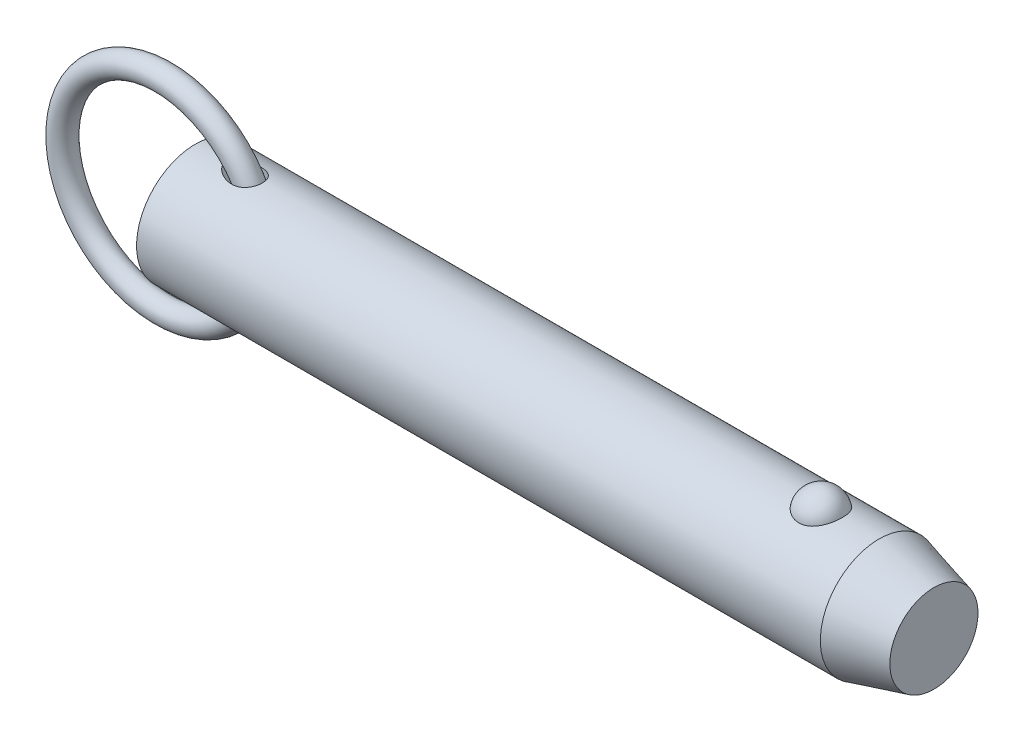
ISO-10303-21;
HEADER;
FILE_DESCRIPTION(('STEP AP214'),'2;1');
FILE_NAME('part.step','',(''),(''),'','','');
FILE_SCHEMA(('AUTOMOTIVE_DESIGN { 1 0 10303 214 1 1 1 1 }'));
ENDSEC;
DATA;
#1=APPLICATION_CONTEXT('core data for automotive mechanical design processes');
#2=APPLICATION_PROTOCOL_DEFINITION('international standard','automotive_design',2000,#1);
#3=PRODUCT_CONTEXT('',#1,'mechanical');
#4=PRODUCT('Part','Part','',(#3));
#5=PRODUCT_RELATED_PRODUCT_CATEGORY('part','',(#4));
#6=PRODUCT_DEFINITION_FORMATION('','',#4);
#7=PRODUCT_DEFINITION_CONTEXT('part definition',#1,'design');
#8=PRODUCT_DEFINITION('design','',#6,#7);
#9=PRODUCT_DEFINITION_SHAPE('','',#8);
#10=(LENGTH_UNIT() NAMED_UNIT(*) SI_UNIT(.MILLI.,.METRE.));
#11=(NAMED_UNIT(*) PLANE_ANGLE_UNIT() SI_UNIT($,.RADIAN.));
#12=(NAMED_UNIT(*) SI_UNIT($,.STERADIAN.) SOLID_ANGLE_UNIT());
#13=UNCERTAINTY_MEASURE_WITH_UNIT(LENGTH_MEASURE(1.E-05),#10,'distance_accuracy_value','');
#14=(GEOMETRIC_REPRESENTATION_CONTEXT(3) GLOBAL_UNCERTAINTY_ASSIGNED_CONTEXT((#13)) GLOBAL_UNIT_ASSIGNED_CONTEXT((#10,
#11,#12)) REPRESENTATION_CONTEXT('',''));
#15=CARTESIAN_POINT('',(0.,0.,0.));
#16=DIRECTION('',(0.,0.,1.));
#17=DIRECTION('',(1.,0.,0.));
#18=AXIS2_PLACEMENT_3D('',#15,#16,#17);
#19=CARTESIAN_POINT('',(-6.08699288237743,0.,0.));
#20=DIRECTION('',(0.,0.,1.));
#21=DIRECTION('',(1.,0.,0.));
#22=AXIS2_PLACEMENT_3D('',#19,#20,#21);
#23=TOROIDAL_SURFACE('',#22,19.05,2.223);
#24=CARTESIAN_POINT('',(15.1860071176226,0.,0.));
#25=VERTEX_POINT('',#24);
#26=VERTEX_LOOP('',#25);
#27=FACE_BOUND('',#26,.T.);
#28=ADVANCED_FACE('P0_F12',(#27),#23,.T.);
#29=CLOSED_SHELL('',(#28));
#30=MANIFOLD_SOLID_BREP('P0_B1',#29);
#31=CARTESIAN_POINT('',(0.,0.,0.));
#32=DIRECTION('',(1.,0.,0.));
#33=DIRECTION('',(0.,0.,-1.));
#34=AXIS2_PLACEMENT_3D('',#31,#32,#33);
#35=CYLINDRICAL_SURFACE('',#34,11.115);
#36=CARTESIAN_POINT('',(6.41405181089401,11.0227946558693,-1.4287136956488));
#37=CARTESIAN_POINT('',(6.49338916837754,11.0115377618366,-1.51556642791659));
#38=CARTESIAN_POINT('',(6.57765461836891,10.9998263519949,-1.59789397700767));
#39=CARTESIAN_POINT('',(6.75386647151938,10.9760304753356,-1.75391400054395));
#40=CARTESIAN_POINT('',(6.84582247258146,10.9639455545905,-1.82759540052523));
#41=CARTESIAN_POINT('',(7.03627827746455,10.9397989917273,-1.96698954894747));
#42=CARTESIAN_POINT('',(7.13480838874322,10.9277377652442,-2.03266078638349));
#43=CARTESIAN_POINT('',(7.33681032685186,10.9041015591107,-2.1558582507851));
#44=CARTESIAN_POINT('',(7.44028007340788,10.8925263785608,-2.21338786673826));
#45=CARTESIAN_POINT('',(7.64386117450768,10.8710104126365,-2.31666528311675));
#46=CARTESIAN_POINT('',(7.74368989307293,10.8610119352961,-2.36295942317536));
#47=CARTESIAN_POINT('',(7.94637195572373,10.8420168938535,-2.44863486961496));
#48=CARTESIAN_POINT('',(8.04922612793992,10.8330206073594,-2.48801426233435));
#49=CARTESIAN_POINT('',(8.36115573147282,10.807980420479,-2.59542730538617));
#50=CARTESIAN_POINT('',(8.57411849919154,10.7938278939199,-2.65299817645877));
#51=CARTESIAN_POINT('',(9.00825016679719,10.7725818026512,-2.73800108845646));
#52=CARTESIAN_POINT('',(9.22947335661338,10.7655491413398,-2.76517330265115));
#53=CARTESIAN_POINT('',(9.67368141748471,10.7605872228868,-2.78445308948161));
#54=CARTESIAN_POINT('',(9.89666486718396,10.7626512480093,-2.77658653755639));
#55=CARTESIAN_POINT('',(10.2950172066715,10.7754452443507,-2.72644436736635));
#56=CARTESIAN_POINT('',(10.4712789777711,10.7844280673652,-2.69109376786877));
#57=CARTESIAN_POINT('',(10.7292776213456,10.8024982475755,-2.61722365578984));
#58=CARTESIAN_POINT('',(10.8142337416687,10.8092901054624,-2.58911576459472));
#59=CARTESIAN_POINT('',(10.9813218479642,10.8242580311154,-2.52581287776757));
#60=CARTESIAN_POINT('',(11.0634550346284,10.8324335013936,-2.49062094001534));
#61=CARTESIAN_POINT('',(11.2247418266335,10.8500287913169,-2.41281958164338));
#62=CARTESIAN_POINT('',(11.3038694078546,10.8594572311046,-2.37015806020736));
#63=CARTESIAN_POINT('',(11.4576781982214,10.8792243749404,-2.27770403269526));
#64=CARTESIAN_POINT('',(11.5323615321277,10.8895626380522,-2.22791497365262));
#65=CARTESIAN_POINT('',(11.6765388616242,10.9108113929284,-2.12140590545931));
#66=CARTESIAN_POINT('',(11.7460329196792,10.9217218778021,-2.06468597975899));
#67=CARTESIAN_POINT('',(11.8790597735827,10.9437207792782,-1.94471764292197));
#68=CARTESIAN_POINT('',(11.9425932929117,10.9548091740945,-1.88147002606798));
#69=CARTESIAN_POINT('',(12.109388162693,10.9851999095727,-1.69784918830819));
#70=CARTESIAN_POINT('',(12.205655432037,11.0042655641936,-1.57093023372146));
#71=CARTESIAN_POINT('',(12.374151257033,11.0393391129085,-1.3017676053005));
#72=CARTESIAN_POINT('',(12.4463875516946,11.0553479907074,-1.15952888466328));
#73=CARTESIAN_POINT('',(12.5615818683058,11.0816338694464,-0.871972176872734));
#74=CARTESIAN_POINT('',(12.6058896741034,11.0921698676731,-0.727217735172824));
#75=CARTESIAN_POINT('',(12.6699315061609,11.1075802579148,-0.432089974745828));
#76=CARTESIAN_POINT('',(12.6896681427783,11.1124552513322,-0.281717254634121));
#77=CARTESIAN_POINT('',(12.7040225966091,11.1159901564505,0.0188164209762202));
#78=CARTESIAN_POINT('',(12.6988836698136,11.1147102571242,0.168965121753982));
#79=CARTESIAN_POINT('',(12.6641681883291,11.1062126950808,0.466238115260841));
#80=CARTESIAN_POINT('',(12.6345920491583,11.0989951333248,0.61336245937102));
#81=CARTESIAN_POINT('',(12.5517453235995,11.0794095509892,0.900330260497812));
#82=CARTESIAN_POINT('',(12.4984878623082,11.0670443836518,1.0401777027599));
#83=CARTESIAN_POINT('',(12.3696588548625,11.0385082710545,1.308745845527));
#84=CARTESIAN_POINT('',(12.2940887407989,11.0223375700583,1.43746725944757));
#85=CARTESIAN_POINT('',(12.122380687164,10.987872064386,1.68079704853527));
#86=CARTESIAN_POINT('',(12.0261637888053,10.969569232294,1.79534850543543));
#87=CARTESIAN_POINT('',(11.8161707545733,10.932836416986,2.00695695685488));
#88=CARTESIAN_POINT('',(11.7023941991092,10.9144064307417,2.10401353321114));
#89=CARTESIAN_POINT('',(11.4575656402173,10.8788057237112,2.28105326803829));
#90=CARTESIAN_POINT('',(11.3261451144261,10.8616794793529,2.36053412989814));
#91=CARTESIAN_POINT('',(11.0523589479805,10.8308019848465,2.49839044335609));
#92=CARTESIAN_POINT('',(10.9099908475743,10.8170514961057,2.55676113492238));
#93=CARTESIAN_POINT('',(10.6060622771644,10.7929728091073,2.65666105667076));
#94=CARTESIAN_POINT('',(10.4438877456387,10.7830209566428,2.69640163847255));
#95=CARTESIAN_POINT('',(10.1154037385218,10.7687230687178,2.75293129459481));
#96=CARTESIAN_POINT('',(9.94909141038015,10.7643810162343,2.76970406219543));
#97=CARTESIAN_POINT('',(9.54387061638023,10.7604809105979,2.7848723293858));
#98=CARTESIAN_POINT('',(9.30446860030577,10.7637793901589,2.77227753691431));
#99=CARTESIAN_POINT('',(8.9496125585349,10.7757341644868,2.72524141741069));
#100=CARTESIAN_POINT('',(8.83186896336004,10.7808994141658,2.70482239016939));
#101=CARTESIAN_POINT('',(8.59835142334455,10.7932548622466,2.6550999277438));
#102=CARTESIAN_POINT('',(8.48257728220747,10.8004448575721,2.62579738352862));
#103=CARTESIAN_POINT('',(8.25208469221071,10.8166382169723,2.55827624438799));
#104=CARTESIAN_POINT('',(8.13740214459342,10.8256649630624,2.51994155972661));
#105=CARTESIAN_POINT('',(7.91132058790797,10.8451170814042,2.43486475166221));
#106=CARTESIAN_POINT('',(7.79992154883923,10.8555424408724,2.38812270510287));
#107=CARTESIAN_POINT('',(7.58115677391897,10.8774251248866,2.28638483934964));
#108=CARTESIAN_POINT('',(7.47378802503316,10.8888816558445,2.23139534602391));
#109=CARTESIAN_POINT('',(7.26385624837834,10.9124540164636,2.1131026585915));
#110=CARTESIAN_POINT('',(7.16129168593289,10.9245696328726,2.04980214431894));
#111=CARTESIAN_POINT('',(6.91882218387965,10.9543689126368,1.88540538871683));
#112=CARTESIAN_POINT('',(6.78193778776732,10.9721958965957,1.77979827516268));
#113=CARTESIAN_POINT('',(6.5247244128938,11.0070222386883,1.54989693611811));
#114=CARTESIAN_POINT('',(6.40436902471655,11.0240228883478,1.42563320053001));
#115=CARTESIAN_POINT('',(6.21838804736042,11.0509658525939,1.19529359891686));
#116=CARTESIAN_POINT('',(6.14691885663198,11.0615430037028,1.09404520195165));
#117=CARTESIAN_POINT('',(6.02043496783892,11.0805004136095,0.881508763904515));
#118=CARTESIAN_POINT('',(5.96539400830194,11.0888841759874,0.770237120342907));
#119=CARTESIAN_POINT('',(5.88475453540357,11.1012553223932,0.560577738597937));
#120=CARTESIAN_POINT('',(5.85559643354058,11.1057686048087,0.463603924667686));
#121=CARTESIAN_POINT('',(5.81381299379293,11.1122523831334,0.266083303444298));
#122=CARTESIAN_POINT('',(5.80117118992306,11.1142254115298,0.165540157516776));
#123=CARTESIAN_POINT('',(5.79363815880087,11.1153999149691,-0.036474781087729));
#124=CARTESIAN_POINT('',(5.79878799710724,11.1145949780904,-0.137948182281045));
#125=CARTESIAN_POINT('',(5.82639592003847,11.1102987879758,-0.338493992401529));
#126=CARTESIAN_POINT('',(5.84887234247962,11.1068046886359,-0.43756374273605));
#127=CARTESIAN_POINT('',(5.91510741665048,11.0965857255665,-0.649968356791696));
#128=CARTESIAN_POINT('',(5.9622090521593,11.0893566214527,-0.762222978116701));
#129=CARTESIAN_POINT('',(6.07378449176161,11.072471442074,-0.977396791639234));
#130=CARTESIAN_POINT('',(6.13826787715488,11.0628140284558,-1.08031079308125));
#131=CARTESIAN_POINT('',(6.2410107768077,11.0477136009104,-1.2219580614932));
#132=CARTESIAN_POINT('',(6.27403486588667,11.042895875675,-1.26469183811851));
#133=CARTESIAN_POINT('',(6.34238022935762,11.0330152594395,-1.34817011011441));
#134=CARTESIAN_POINT('',(6.37769867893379,11.0279526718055,-1.38891694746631));
#135=CARTESIAN_POINT('',(6.41405181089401,11.0227946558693,-1.4287136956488));
#136=B_SPLINE_CURVE_WITH_KNOTS('',3,(#36,#37,#38,#39,#40,#41,#42,#43,#44,#45,#46,#47,#48,#49,
#50,#51,#52,#53,#54,#55,#56,#57,#58,#59,#60,#61,#62,#63,#64,#65,#66,#67,#68,#69,#70,#71,#72,#73,
#74,#75,#76,#77,#78,#79,#80,#81,#82,#83,#84,#85,#86,#87,#88,#89,#90,#91,#92,#93,#94,#95,#96,#97,
#98,#99,#100,#101,#102,#103,#104,#105,#106,#107,#108,#109,#110,#111,#112,#113,#114,#115,#116,
#117,#118,#119,#120,#121,#122,#123,#124,#125,#126,#127,#128,#129,#130,#131,#132,#133,#134,#135),
.UNSPECIFIED.,.T.,.F.,(4,2,2,2,2,2,2,2,2,2,2,2,2,2,2,2,2,2,2,2,2,2,2,2,2,2,2,2,2,2,2,2,2,2,2,2,
2,2,2,2,2,2,2,2,2,2,2,2,2,4),(0.,0.35443329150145,0.709315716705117,1.0659654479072,
1.42246628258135,1.7536715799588,2.08496839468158,2.74582009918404,3.41227815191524,
4.07824412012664,4.61583787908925,4.88478112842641,5.1536085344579,5.42439170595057,
5.69504436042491,5.96569375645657,6.23631025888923,6.71490729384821,7.19335005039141,
7.64641437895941,8.09943057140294,8.54802575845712,8.99661331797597,9.44495256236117,
9.89326303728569,10.3433195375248,10.7933867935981,11.2550086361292,11.7167345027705,
12.2165866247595,12.7167934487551,13.4318876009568,13.7904664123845,14.1490092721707,
14.5124394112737,14.8758662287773,15.239015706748,15.6020483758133,16.1219860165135,
16.6410830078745,17.0130520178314,17.3844231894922,17.6872330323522,17.9897407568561,
18.2929471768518,18.5964749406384,18.9603532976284,19.3244326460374,19.4870338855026,
19.649438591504),.UNSPECIFIED.);
#137=CARTESIAN_POINT('',(6.41405181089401,11.0227946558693,-1.4287136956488));
#138=VERTEX_POINT('',#137);
#139=EDGE_CURVE('P1_E40',#138,#138,#136,.T.);
#140=ORIENTED_EDGE('',*,*,#139,.T.);
#141=EDGE_LOOP('',(#140));
#142=FACE_BOUND('',#141,.T.);
#143=CARTESIAN_POINT('',(129.329563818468,0.,0.));
#144=DIRECTION('',(1.,0.,0.));
#145=DIRECTION('',(0.,0.,-1.));
#146=AXIS2_PLACEMENT_3D('',#143,#144,#145);
#147=CIRCLE('',#146,11.115);
#148=CARTESIAN_POINT('',(129.329563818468,0.,-11.115));
#149=VERTEX_POINT('',#148);
#150=EDGE_CURVE('P1_E25',#149,#149,#147,.T.);
#151=ORIENTED_EDGE('',*,*,#150,.F.);
#152=EDGE_LOOP('',(#151));
#153=FACE_BOUND('',#152,.T.);
#154=CARTESIAN_POINT('',(0.,0.,0.));
#155=DIRECTION('',(1.,0.,0.));
#156=DIRECTION('',(0.,0.,-1.));
#157=AXIS2_PLACEMENT_3D('',#154,#155,#156);
#158=CIRCLE('',#157,11.115);
#159=CARTESIAN_POINT('',(0.,0.,-11.115));
#160=VERTEX_POINT('',#159);
#161=EDGE_CURVE('P1_E9',#160,#160,#158,.T.);
#162=ORIENTED_EDGE('',*,*,#161,.T.);
#163=EDGE_LOOP('',(#162));
#164=FACE_BOUND('',#163,.T.);
#165=CARTESIAN_POINT('',(118.331068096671,10.3028087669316,4.17077409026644));
#166=CARTESIAN_POINT('',(118.114775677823,10.3028003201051,4.17078240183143));
#167=CARTESIAN_POINT('',(117.898548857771,10.3098895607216,4.15340593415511));
#168=CARTESIAN_POINT('',(117.472540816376,10.3373834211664,4.08449540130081));
#169=CARTESIAN_POINT('',(117.262757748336,10.3577841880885,4.03297121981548));
#170=CARTESIAN_POINT('',(116.855782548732,10.4095237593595,3.89746513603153));
#171=CARTESIAN_POINT('',(116.658572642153,10.4408466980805,3.81353029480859));
#172=CARTESIAN_POINT('',(116.281338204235,10.5110236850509,3.61560339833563));
#173=CARTESIAN_POINT('',(116.101317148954,10.5498792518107,3.50160528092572));
#174=CARTESIAN_POINT('',(115.757684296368,10.6322884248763,3.24292464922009));
#175=CARTESIAN_POINT('',(115.594686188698,10.6759443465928,3.09746040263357));
#176=CARTESIAN_POINT('',(115.294591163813,10.7625291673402,2.78171925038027));
#177=CARTESIAN_POINT('',(115.157499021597,10.8054579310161,2.61143778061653));
#178=CARTESIAN_POINT('',(114.906408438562,10.8881935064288,2.24226695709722));
#179=CARTESIAN_POINT('',(114.793710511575,10.9277761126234,2.04244123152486));
#180=CARTESIAN_POINT('',(114.601777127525,10.997484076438,1.62578254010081));
#181=CARTESIAN_POINT('',(114.522544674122,11.0276085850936,1.40894804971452));
#182=CARTESIAN_POINT('',(114.398303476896,11.0756732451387,0.961250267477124));
#183=CARTESIAN_POINT('',(114.353760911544,11.0934470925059,0.730239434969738));
#184=CARTESIAN_POINT('',(114.301569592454,11.1143331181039,0.263439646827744));
#185=CARTESIAN_POINT('',(114.293920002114,11.1174456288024,0.0276507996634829));
#186=CARTESIAN_POINT('',(114.31561056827,11.1087161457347,-0.440729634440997));
#187=CARTESIAN_POINT('',(114.344762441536,11.0969502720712,-0.673331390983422));
#188=CARTESIAN_POINT('',(114.439143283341,11.0597872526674,-1.1299662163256));
#189=CARTESIAN_POINT('',(114.504372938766,11.0343898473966,-1.35399912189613));
#190=CARTESIAN_POINT('',(114.66969844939,10.972515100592,-1.78750286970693));
#191=CARTESIAN_POINT('',(114.76983863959,10.9360236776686,-1.99695478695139));
#192=CARTESIAN_POINT('',(115.002940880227,10.8557595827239,-2.3952066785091));
#193=CARTESIAN_POINT('',(115.135905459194,10.8119863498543,-2.5840050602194));
#194=CARTESIAN_POINT('',(115.432407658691,10.7216733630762,-2.93635726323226));
#195=CARTESIAN_POINT('',(115.596056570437,10.675123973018,-3.09981510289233));
#196=CARTESIAN_POINT('',(115.949860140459,10.5846571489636,-3.39592247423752));
#197=CARTESIAN_POINT('',(116.140012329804,10.5407394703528,-3.52857487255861));
#198=CARTESIAN_POINT('',(116.53750141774,10.4616690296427,-3.75646057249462));
#199=CARTESIAN_POINT('',(116.74436705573,10.4263443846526,-3.8524543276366));
#200=CARTESIAN_POINT('',(117.172954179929,10.3675574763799,-4.00798747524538));
#201=CARTESIAN_POINT('',(117.394670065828,10.344090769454,-4.06754052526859));
#202=CARTESIAN_POINT('',(117.834669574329,10.3128282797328,-4.14614314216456));
#203=CARTESIAN_POINT('',(118.052565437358,10.3043040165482,-4.16707833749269));
#204=CARTESIAN_POINT('',(118.48894951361,10.3016771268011,-4.17357158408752));
#205=CARTESIAN_POINT('',(118.707437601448,10.3075716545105,-4.15913661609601));
#206=CARTESIAN_POINT('',(119.131744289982,10.3326686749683,-4.09636961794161));
#207=CARTESIAN_POINT('',(119.337745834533,10.3514555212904,-4.04909574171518));
#208=CARTESIAN_POINT('',(119.738576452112,10.399818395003,-3.92320197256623));
#209=CARTESIAN_POINT('',(119.9334046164,10.4293952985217,-3.84457953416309));
#210=CARTESIAN_POINT('',(120.311191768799,10.4969600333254,-3.6561241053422));
#211=CARTESIAN_POINT('',(120.493797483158,10.5351178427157,-3.54564545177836));
#212=CARTESIAN_POINT('',(120.838204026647,10.6154999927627,-3.29718036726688));
#213=CARTESIAN_POINT('',(121.000000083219,10.657725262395,-3.15918764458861));
#214=CARTESIAN_POINT('',(121.306959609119,10.744212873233,-2.85163580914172));
#215=CARTESIAN_POINT('',(121.450891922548,10.7884718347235,-2.680846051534));
#216=CARTESIAN_POINT('',(121.709237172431,10.872374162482,-2.31721864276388));
#217=CARTESIAN_POINT('',(121.823644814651,10.9120167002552,-2.1243770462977));
#218=CARTESIAN_POINT('',(122.023873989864,10.9838919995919,-1.7151699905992));
#219=CARTESIAN_POINT('',(122.10866178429,11.0158465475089,-1.49824866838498));
#220=CARTESIAN_POINT('',(122.24268382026,11.0673523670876,-1.05228572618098));
#221=CARTESIAN_POINT('',(122.291917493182,11.086903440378,-0.82324391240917));
#222=CARTESIAN_POINT('',(122.353891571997,11.1116323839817,-0.359087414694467));
#223=CARTESIAN_POINT('',(122.366566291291,11.1167843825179,-0.123962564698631));
#224=CARTESIAN_POINT('',(122.354973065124,11.1121144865,0.345220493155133));
#225=CARTESIAN_POINT('',(122.330705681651,11.1022928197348,0.579278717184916));
#226=CARTESIAN_POINT('',(122.245907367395,11.0687504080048,1.03866534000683));
#227=CARTESIAN_POINT('',(122.185529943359,11.0450885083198,1.2640264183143));
#228=CARTESIAN_POINT('',(122.029853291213,10.9863185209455,1.70076772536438));
#229=CARTESIAN_POINT('',(121.934551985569,10.9512097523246,1.91214712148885));
#230=CARTESIAN_POINT('',(121.710397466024,10.8729733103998,2.31608359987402));
#231=CARTESIAN_POINT('',(121.581380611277,10.8298068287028,2.50854240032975));
#232=CARTESIAN_POINT('',(121.292732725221,10.7401896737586,2.86808766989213));
#233=CARTESIAN_POINT('',(121.133102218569,10.6937390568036,3.03517457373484));
#234=CARTESIAN_POINT('',(120.787534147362,10.6029321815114,3.33857581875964));
#235=CARTESIAN_POINT('',(120.601708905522,10.5585680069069,3.47501541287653));
#236=CARTESIAN_POINT('',(120.207875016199,10.4769321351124,3.71390897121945));
#237=CARTESIAN_POINT('',(119.999863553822,10.439661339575,3.81635861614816));
#238=CARTESIAN_POINT('',(119.554066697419,10.3749407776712,3.98910631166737));
#239=CARTESIAN_POINT('',(119.315234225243,10.3482457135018,4.05700929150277));
#240=CARTESIAN_POINT('',(118.827925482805,10.312188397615,4.14782844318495));
#241=CARTESIAN_POINT('',(118.579453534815,10.3028184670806,4.17076454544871));
#242=CARTESIAN_POINT('',(118.331068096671,10.3028087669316,4.17077409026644));
#243=B_SPLINE_CURVE_WITH_KNOTS('',3,(#165,#166,#167,#168,#169,#170,#171,#172,#173,#174,#175,
#176,#177,#178,#179,#180,#181,#182,#183,#184,#185,#186,#187,#188,#189,#190,#191,#192,#193,#194,
#195,#196,#197,#198,#199,#200,#201,#202,#203,#204,#205,#206,#207,#208,#209,#210,#211,#212,#213,
#214,#215,#216,#217,#218,#219,#220,#221,#222,#223,#224,#225,#226,#227,#228,#229,#230,#231,#232,
#233,#234,#235,#236,#237,#238,#239,#240,#241,#242),.UNSPECIFIED.,.T.,.F.,(4,2,2,2,2,2,2,2,2,2,2,
2,2,2,2,2,2,2,2,2,2,2,2,2,2,2,2,2,2,2,2,2,2,2,2,2,2,2,4),(0.,0.647966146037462,1.29574482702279,
1.94258643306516,2.58955857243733,3.25496465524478,3.92049326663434,4.61566368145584,
5.31089647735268,6.01531821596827,6.71972398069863,7.42054043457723,8.12137023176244,
8.8230933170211,9.52487047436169,10.2292439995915,10.9335519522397,11.6223330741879,
12.3108558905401,12.9647664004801,13.6185478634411,14.252184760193,14.8858731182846,
15.5334360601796,16.1811472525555,16.8611459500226,17.5412664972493,18.2431855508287,
18.9451158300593,19.6483065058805,20.3514864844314,21.0516982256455,21.7519516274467,
22.4556690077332,23.1593743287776,23.860149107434,24.5610129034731,25.3054529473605,
26.0495629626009),.UNSPECIFIED.);
#244=CARTESIAN_POINT('',(118.331068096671,10.3028087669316,4.17077409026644));
#245=VERTEX_POINT('',#244);
#246=EDGE_CURVE('P1_E34',#245,#245,#243,.T.);
#247=ORIENTED_EDGE('',*,*,#246,.T.);
#248=EDGE_LOOP('',(#247));
#249=FACE_BOUND('',#248,.T.);
#250=CARTESIAN_POINT('',(6.41405181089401,-11.0227946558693,-1.4287136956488));
#251=CARTESIAN_POINT('',(6.33124061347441,-11.0345445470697,-1.33806125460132));
#252=CARTESIAN_POINT('',(6.25372866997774,-11.0458090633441,-1.24240732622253));
#253=CARTESIAN_POINT('',(6.11277905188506,-11.0666115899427,-1.04095704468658));
#254=CARTESIAN_POINT('',(6.0493392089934,-11.0761498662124,-0.935162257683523));
#255=CARTESIAN_POINT('',(5.94029181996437,-11.0927063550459,-0.712476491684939));
#256=CARTESIAN_POINT('',(5.89492964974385,-11.0996897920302,-0.595457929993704));
#257=CARTESIAN_POINT('',(5.8449816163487,-11.1074141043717,-0.414997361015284));
#258=CARTESIAN_POINT('',(5.83135004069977,-11.1095300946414,-0.354047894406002));
#259=CARTESIAN_POINT('',(5.81051649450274,-11.1127688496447,-0.231041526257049));
#260=CARTESIAN_POINT('',(5.80331311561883,-11.1138918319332,-0.1689848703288));
#261=CARTESIAN_POINT('',(5.79296529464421,-11.1155042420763,-0.000484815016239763));
#262=CARTESIAN_POINT('',(5.79625267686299,-11.1149904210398,0.106437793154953));
#263=CARTESIAN_POINT('',(5.82213676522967,-11.1109609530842,0.317809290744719));
#264=CARTESIAN_POINT('',(5.84474662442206,-11.1074432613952,0.422256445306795));
#265=CARTESIAN_POINT('',(5.91113114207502,-11.097197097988,0.63936180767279));
#266=CARTESIAN_POINT('',(5.95733120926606,-11.090102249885,0.751250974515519));
#267=CARTESIAN_POINT('',(6.06709542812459,-11.0734770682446,0.965912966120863));
#268=CARTESIAN_POINT('',(6.13068735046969,-11.06394284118,1.06867085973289));
#269=CARTESIAN_POINT('',(6.30294237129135,-11.0385920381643,1.30890635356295));
#270=CARTESIAN_POINT('',(6.4189620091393,-11.0218881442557,1.44097376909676));
#271=CARTESIAN_POINT('',(6.66989654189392,-10.9871512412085,1.68553954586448));
#272=CARTESIAN_POINT('',(6.80485520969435,-10.9691152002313,1.79799117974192));
#273=CARTESIAN_POINT('',(7.04881236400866,-10.9382283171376,1.97587596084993));
#274=CARTESIAN_POINT('',(7.15465712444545,-10.9253240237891,2.04570822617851));
#275=CARTESIAN_POINT('',(7.37202504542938,-10.9000987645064,2.17611840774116));
#276=CARTESIAN_POINT('',(7.48355057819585,-10.8877780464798,2.23669241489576));
#277=CARTESIAN_POINT('',(7.71132418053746,-10.8641580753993,2.34873831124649));
#278=CARTESIAN_POINT('',(7.82757727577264,-10.8528599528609,2.40020018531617));
#279=CARTESIAN_POINT('',(8.06386825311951,-10.8317234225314,2.49385169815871));
#280=CARTESIAN_POINT('',(8.18390558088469,-10.8218848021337,2.53604268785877));
#281=CARTESIAN_POINT('',(8.42918336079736,-10.8039208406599,2.61152283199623));
#282=CARTESIAN_POINT('',(8.55447802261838,-10.7958283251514,2.64464414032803));
#283=CARTESIAN_POINT('',(8.80752127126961,-10.781995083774,2.70048793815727));
#284=CARTESIAN_POINT('',(8.9352701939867,-10.7762546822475,2.72320899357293));
#285=CARTESIAN_POINT('',(9.19210176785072,-10.7675291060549,2.75750994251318));
#286=CARTESIAN_POINT('',(9.32118105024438,-10.7645381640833,2.76911315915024));
#287=CARTESIAN_POINT('',(9.57984338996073,-10.761622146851,2.78042035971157));
#288=CARTESIAN_POINT('',(9.70942621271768,-10.7616957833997,2.78012934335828));
#289=CARTESIAN_POINT('',(10.0243125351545,-10.7659059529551,2.76381534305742));
#290=CARTESIAN_POINT('',(10.209307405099,-10.7717977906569,2.74099674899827));
#291=CARTESIAN_POINT('',(10.5731188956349,-10.7905408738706,2.66626238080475));
#292=CARTESIAN_POINT('',(10.7519389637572,-10.8033881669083,2.61436313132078));
#293=CARTESIAN_POINT('',(11.0114289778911,-10.8271584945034,2.51336808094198));
#294=CARTESIAN_POINT('',(11.0968318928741,-10.835881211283,2.47562331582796));
#295=CARTESIAN_POINT('',(11.2636000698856,-10.8545688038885,2.39236170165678));
#296=CARTESIAN_POINT('',(11.344967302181,-10.8645330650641,2.3468486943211));
#297=CARTESIAN_POINT('',(11.5027832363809,-10.8853818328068,2.24815967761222));
#298=CARTESIAN_POINT('',(11.5792327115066,-10.8962661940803,2.19498487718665));
#299=CARTESIAN_POINT('',(11.7263315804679,-10.9185541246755,2.08128855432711));
#300=CARTESIAN_POINT('',(11.7969818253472,-10.9299576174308,2.02076811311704));
#301=CARTESIAN_POINT('',(11.9817953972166,-10.9613645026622,1.84513663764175));
#302=CARTESIAN_POINT('',(12.0893012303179,-10.9814643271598,1.72286660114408));
#303=CARTESIAN_POINT('',(12.2803576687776,-11.0193991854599,1.46066991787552));
#304=CARTESIAN_POINT('',(12.3639173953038,-11.0372350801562,1.32075002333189));
#305=CARTESIAN_POINT('',(12.4996220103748,-11.0672969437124,1.03778067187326));
#306=CARTESIAN_POINT('',(12.5535315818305,-11.0798242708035,0.895607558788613));
#307=CARTESIAN_POINT('',(12.636874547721,-11.0995427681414,0.603918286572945));
#308=CARTESIAN_POINT('',(12.6663115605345,-11.1067347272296,0.454403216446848));
#309=CARTESIAN_POINT('',(12.6997387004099,-11.1149224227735,0.154577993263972));
#310=CARTESIAN_POINT('',(12.7040886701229,-11.1160057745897,0.00431019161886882));
#311=CARTESIAN_POINT('',(12.6882048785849,-11.1120956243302,-0.294841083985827));
#312=CARTESIAN_POINT('',(12.6679715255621,-11.1071022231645,-0.44372458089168));
#313=CARTESIAN_POINT('',(12.6034470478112,-11.0915888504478,-0.735688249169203));
#314=CARTESIAN_POINT('',(12.5591858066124,-11.0810757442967,-0.878775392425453));
#315=CARTESIAN_POINT('',(12.4477416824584,-11.0556687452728,-1.15529525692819));
#316=CARTESIAN_POINT('',(12.3805601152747,-11.0407751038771,-1.2887285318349));
#317=CARTESIAN_POINT('',(12.2248919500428,-11.0081839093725,-1.54257976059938));
#318=CARTESIAN_POINT('',(12.1363549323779,-10.9904797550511,-1.66296592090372));
#319=CARTESIAN_POINT('',(11.9406137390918,-10.9541951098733,-1.88726577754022));
#320=CARTESIAN_POINT('',(11.833409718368,-10.9356146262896,-1.99117961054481));
#321=CARTESIAN_POINT('',(11.601318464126,-10.8991360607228,-2.18213646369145));
#322=CARTESIAN_POINT('',(11.4761325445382,-10.8812577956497,-2.26881927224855));
#323=CARTESIAN_POINT('',(11.2134852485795,-10.8482871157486,-2.42157282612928));
#324=CARTESIAN_POINT('',(11.0760218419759,-10.8331951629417,-2.48764015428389));
#325=CARTESIAN_POINT('',(10.7828968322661,-10.8061050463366,-2.60290068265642));
#326=CARTESIAN_POINT('',(10.6266338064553,-10.7943907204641,-2.65062248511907));
#327=CARTESIAN_POINT('',(10.3086617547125,-10.7762429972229,-2.72345054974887));
#328=CARTESIAN_POINT('',(10.146948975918,-10.7698133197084,-2.74854088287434));
#329=CARTESIAN_POINT('',(9.75541304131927,-10.7608036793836,-2.78368719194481));
#330=CARTESIAN_POINT('',(9.52459435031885,-10.7608467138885,-2.78350276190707));
#331=CARTESIAN_POINT('',(9.06604960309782,-10.7702674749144,-2.74677945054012));
#332=CARTESIAN_POINT('',(8.83832966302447,-10.7796615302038,-2.71017697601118));
#333=CARTESIAN_POINT('',(8.38783466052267,-10.8058248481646,-2.60392490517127));
#334=CARTESIAN_POINT('',(8.16517101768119,-10.8226939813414,-2.53382676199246));
#335=CARTESIAN_POINT('',(7.84087311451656,-10.8516548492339,-2.40555545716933));
#336=CARTESIAN_POINT('',(7.73435551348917,-10.8619221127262,-2.35892455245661));
#337=CARTESIAN_POINT('',(7.52510420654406,-10.883357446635,-2.25797017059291));
#338=CARTESIAN_POINT('',(7.4223698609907,-10.8945253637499,-2.20364800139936));
#339=CARTESIAN_POINT('',(7.23808758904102,-10.915528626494,-2.09688018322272));
#340=CARTESIAN_POINT('',(7.15584631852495,-10.9252787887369,-2.0456107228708));
#341=CARTESIAN_POINT('',(6.99510576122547,-10.944960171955,-1.93754729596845));
#342=CARTESIAN_POINT('',(6.91660574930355,-10.9548913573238,-1.88075440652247));
#343=CARTESIAN_POINT('',(6.76418133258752,-10.974690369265,-1.76154504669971));
#344=CARTESIAN_POINT('',(6.69024940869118,-10.9845582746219,-1.6991382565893));
#345=CARTESIAN_POINT('',(6.54780119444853,-11.0039826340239,-1.56842485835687));
#346=CARTESIAN_POINT('',(6.47928247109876,-11.0135392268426,-1.50012092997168));
#347=CARTESIAN_POINT('',(6.41405181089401,-11.0227946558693,-1.4287136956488));
#348=B_SPLINE_CURVE_WITH_KNOTS('',3,(#250,#251,#252,#253,#254,#255,#256,#257,#258,#259,#260,
#261,#262,#263,#264,#265,#266,#267,#268,#269,#270,#271,#272,#273,#274,#275,#276,#277,#278,#279,
#280,#281,#282,#283,#284,#285,#286,#287,#288,#289,#290,#291,#292,#293,#294,#295,#296,#297,#298,
#299,#300,#301,#302,#303,#304,#305,#306,#307,#308,#309,#310,#311,#312,#313,#314,#315,#316,#317,
#318,#319,#320,#321,#322,#323,#324,#325,#326,#327,#328,#329,#330,#331,#332,#333,#334,#335,#336,
#337,#338,#339,#340,#341,#342,#343,#344,#345,#346,#347),.UNSPECIFIED.,.T.,.F.,(4,2,2,2,2,2,2,2,
2,2,2,2,2,2,2,2,2,2,2,2,2,2,2,2,2,2,2,2,2,2,2,2,2,2,2,2,2,2,2,2,2,2,2,2,2,2,2,2,4),(0.,
0.36983565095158,0.739614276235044,1.1142538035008,1.30141910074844,1.48854338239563,
1.8074587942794,2.12659146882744,2.4883888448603,2.85076733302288,3.3776216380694,
3.90571433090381,4.287639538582,4.66972556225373,5.05222896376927,5.43467659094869,
5.82378546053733,6.21294796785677,6.6012922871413,6.98947336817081,7.54669558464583,
8.10360148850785,8.3845853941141,8.66543074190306,8.94623182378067,9.22699162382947,
9.7162888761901,10.2053995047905,10.6608871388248,11.1163074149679,11.5651786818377,
12.0140424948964,12.4623493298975,12.9106304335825,13.3599804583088,13.8093267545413,
14.2672570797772,14.7252632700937,15.214740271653,15.7045615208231,16.3932594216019,
17.083162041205,17.7825738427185,18.1325177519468,18.4824022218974,18.7744056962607,
19.0663523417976,19.3578048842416,19.6491256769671),.UNSPECIFIED.);
#349=CARTESIAN_POINT('',(6.41405181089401,-11.0227946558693,-1.4287136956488));
#350=VERTEX_POINT('',#349);
#351=EDGE_CURVE('P1_E17',#350,#350,#348,.T.);
#352=ORIENTED_EDGE('',*,*,#351,.T.);
#353=EDGE_LOOP('',(#352));
#354=FACE_BOUND('',#353,.T.);
#355=ADVANCED_FACE('P1_F13',(#142,#153,#164,#249,#354),#35,.T.);
#356=CARTESIAN_POINT('',(0.,0.,0.));
#357=DIRECTION('',(-1.,0.,0.));
#358=DIRECTION('',(0.,0.,1.));
#359=AXIS2_PLACEMENT_3D('',#356,#357,#358);
#360=PLANE('',#359);
#361=ORIENTED_EDGE('',*,*,#161,.F.);
#362=EDGE_LOOP('',(#361));
#363=FACE_BOUND('',#362,.T.);
#364=ADVANCED_FACE('P1_F15',(#363),#360,.T.);
#365=CARTESIAN_POINT('',(139.7,0.,0.));
#366=DIRECTION('',(-1.,0.,0.));
#367=DIRECTION('',(0.,0.,1.));
#368=AXIS2_PLACEMENT_3D('',#365,#366,#367);
#369=CONICAL_SURFACE('',#368,8.33625000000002,0.26179938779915);
#370=ORIENTED_EDGE('',*,*,#150,.T.);
#371=EDGE_LOOP('',(#370));
#372=FACE_BOUND('',#371,.T.);
#373=CARTESIAN_POINT('',(139.7,0.,0.));
#374=DIRECTION('',(1.,0.,0.));
#375=DIRECTION('',(0.,0.,-1.));
#376=AXIS2_PLACEMENT_3D('',#373,#374,#375);
#377=CIRCLE('',#376,8.33625000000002);
#378=CARTESIAN_POINT('',(139.7,0.,-8.33625000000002));
#379=VERTEX_POINT('',#378);
#380=EDGE_CURVE('P1_E30',#379,#379,#377,.T.);
#381=ORIENTED_EDGE('',*,*,#380,.F.);
#382=EDGE_LOOP('',(#381));
#383=FACE_BOUND('',#382,.T.);
#384=ADVANCED_FACE('P1_F55',(#372,#383),#369,.T.);
#385=CARTESIAN_POINT('',(139.7,8.33625000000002,0.));
#386=DIRECTION('',(1.,0.,0.));
#387=DIRECTION('',(0.,0.,-1.));
#388=AXIS2_PLACEMENT_3D('',#385,#386,#387);
#389=PLANE('',#388);
#390=ORIENTED_EDGE('',*,*,#380,.T.);
#391=EDGE_LOOP('',(#390));
#392=FACE_BOUND('',#391,.T.);
#393=ADVANCED_FACE('P1_F51',(#392),#389,.T.);
#394=CARTESIAN_POINT('',(118.331068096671,10.0035,0.));
#395=DIRECTION('',(-1.,0.,0.));
#396=DIRECTION('',(0.,1.,0.));
#397=AXIS2_PLACEMENT_3D('',#394,#395,#396);
#398=SPHERICAL_SURFACE('',#397,4.18149999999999);
#399=ORIENTED_EDGE('',*,*,#246,.F.);
#400=EDGE_LOOP('',(#399));
#401=FACE_BOUND('',#400,.T.);
#402=ADVANCED_FACE('P1_F46',(#401),#398,.T.);
#403=CARTESIAN_POINT('',(-6.08699288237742,0.,0.));
#404=DIRECTION('',(0.,0.,1.));
#405=DIRECTION('',(1.,0.,0.));
#406=AXIS2_PLACEMENT_3D('',#403,#404,#405);
#407=TOROIDAL_SURFACE('',#406,19.05,2.77875);
#408=ORIENTED_EDGE('',*,*,#351,.F.);
#409=EDGE_LOOP('',(#408));
#410=FACE_BOUND('',#409,.T.);
#411=ORIENTED_EDGE('',*,*,#139,.F.);
#412=EDGE_LOOP('',(#411));
#413=FACE_BOUND('',#412,.T.);
#414=ADVANCED_FACE('P1_F50',(#410,#413),#407,.F.);
#415=CLOSED_SHELL('',(#355,#364,#384,#393,#402,#414));
#416=MANIFOLD_SOLID_BREP('P1_B1',#415);
#417=ADVANCED_BREP_SHAPE_REPRESENTATION('',(#18,#30,#416),#14);
#418=SHAPE_DEFINITION_REPRESENTATION(#9,#417);
ENDSEC;
END-ISO-10303-21;
